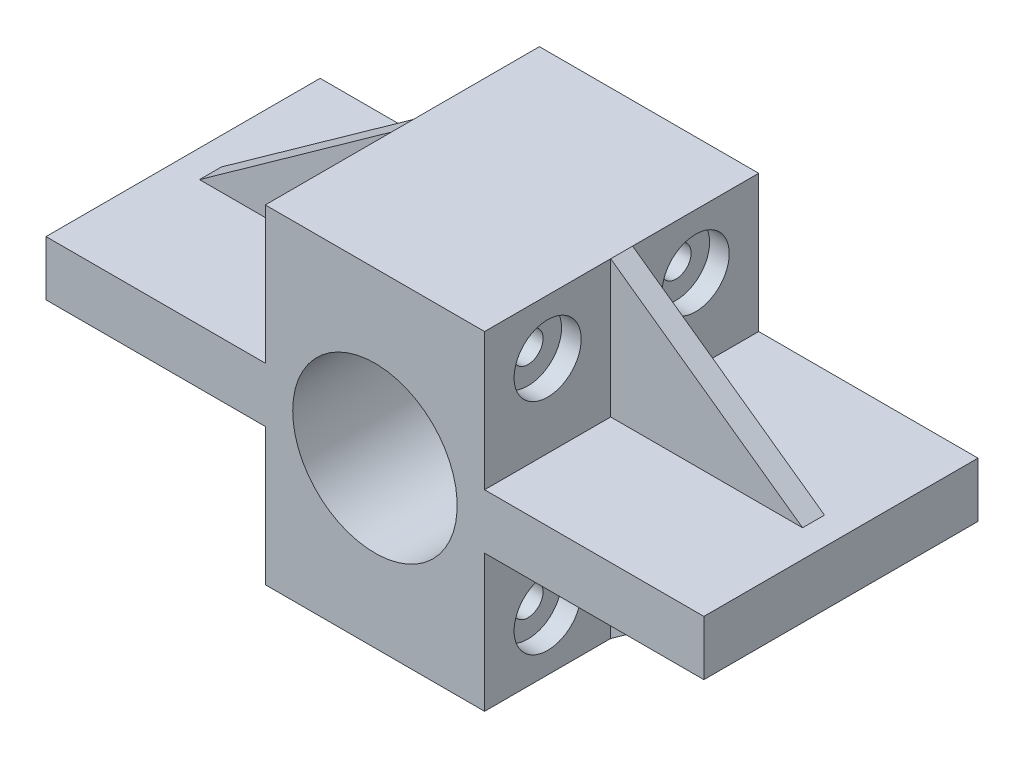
ISO-10303-21;
HEADER;
FILE_DESCRIPTION(('STEP AP214'),'2;1');
FILE_NAME('part.step','',(''),(''),'','','');
FILE_SCHEMA(('AUTOMOTIVE_DESIGN { 1 0 10303 214 1 1 1 1 }'));
ENDSEC;
DATA;
#1=APPLICATION_CONTEXT('core data for automotive mechanical design processes');
#2=APPLICATION_PROTOCOL_DEFINITION('international standard','automotive_design',2000,#1);
#3=PRODUCT_CONTEXT('',#1,'mechanical');
#4=PRODUCT('Part','Part','',(#3));
#5=PRODUCT_RELATED_PRODUCT_CATEGORY('part','',(#4));
#6=PRODUCT_DEFINITION_FORMATION('','',#4);
#7=PRODUCT_DEFINITION_CONTEXT('part definition',#1,'design');
#8=PRODUCT_DEFINITION('design','',#6,#7);
#9=PRODUCT_DEFINITION_SHAPE('','',#8);
#10=(LENGTH_UNIT() NAMED_UNIT(*) SI_UNIT(.MILLI.,.METRE.));
#11=(NAMED_UNIT(*) PLANE_ANGLE_UNIT() SI_UNIT($,.RADIAN.));
#12=(NAMED_UNIT(*) SI_UNIT($,.STERADIAN.) SOLID_ANGLE_UNIT());
#13=UNCERTAINTY_MEASURE_WITH_UNIT(LENGTH_MEASURE(1.E-05),#10,'distance_accuracy_value','');
#14=(GEOMETRIC_REPRESENTATION_CONTEXT(3) GLOBAL_UNCERTAINTY_ASSIGNED_CONTEXT((#13)) GLOBAL_UNIT_ASSIGNED_CONTEXT((#10,
#11,#12)) REPRESENTATION_CONTEXT('',''));
#15=CARTESIAN_POINT('',(0.,0.,0.));
#16=DIRECTION('',(0.,0.,1.));
#17=DIRECTION('',(1.,0.,0.));
#18=AXIS2_PLACEMENT_3D('',#15,#16,#17);
#19=CARTESIAN_POINT('',(-20.,5.,25.));
#20=DIRECTION('',(1.,0.,0.));
#21=DIRECTION('',(0.,1.,0.));
#22=AXIS2_PLACEMENT_3D('',#19,#20,#21);
#23=PLANE('',#22);
#24=CARTESIAN_POINT('',(-20.,20.,-13.5));
#25=DIRECTION('',(-1.,0.,0.));
#26=DIRECTION('',(0.,0.,1.));
#27=AXIS2_PLACEMENT_3D('',#24,#25,#26);
#28=CIRCLE('',#27,6.12);
#29=CARTESIAN_POINT('',(-20.,20.,-7.38));
#30=VERTEX_POINT('',#29);
#31=EDGE_CURVE('E373',#30,#30,#28,.T.);
#32=ORIENTED_EDGE('',*,*,#31,.F.);
#33=EDGE_LOOP('',(#32));
#34=FACE_BOUND('',#33,.T.);
#35=DIRECTION('',(0.,-1.,0.));
#36=VECTOR('',#35,1.);
#37=CARTESIAN_POINT('',(-20.,5.,-2.));
#38=LINE('',#37,#36);
#39=CARTESIAN_POINT('',(-20.,30.,-2.));
#40=VERTEX_POINT('',#39);
#41=CARTESIAN_POINT('',(-20.,5.,-2.));
#42=VERTEX_POINT('',#41);
#43=EDGE_CURVE('E48',#40,#42,#38,.T.);
#44=ORIENTED_EDGE('',*,*,#43,.F.);
#45=DIRECTION('',(0.,0.,-1.));
#46=VECTOR('',#45,1.);
#47=CARTESIAN_POINT('',(-20.,30.,25.));
#48=LINE('',#47,#46);
#49=CARTESIAN_POINT('',(-20.,30.,-25.));
#50=VERTEX_POINT('',#49);
#51=EDGE_CURVE('E492',#40,#50,#48,.T.);
#52=ORIENTED_EDGE('',*,*,#51,.T.);
#53=DIRECTION('',(0.,-1.,0.));
#54=VECTOR('',#53,1.);
#55=CARTESIAN_POINT('',(-20.,5.,-25.));
#56=LINE('',#55,#54);
#57=CARTESIAN_POINT('',(-20.,5.,-25.));
#58=VERTEX_POINT('',#57);
#59=EDGE_CURVE('E480',#50,#58,#56,.T.);
#60=ORIENTED_EDGE('',*,*,#59,.T.);
#61=DIRECTION('',(0.,0.,-1.));
#62=VECTOR('',#61,1.);
#63=CARTESIAN_POINT('',(-20.,5.,25.));
#64=LINE('',#63,#62);
#65=EDGE_CURVE('E488',#42,#58,#64,.T.);
#66=ORIENTED_EDGE('',*,*,#65,.F.);
#67=EDGE_LOOP('',(#44,#52,#60,#66));
#68=FACE_BOUND('',#67,.T.);
#69=ADVANCED_FACE('F33',(#34,#68),#23,.F.);
#70=CARTESIAN_POINT('',(20.,5.,25.));
#71=DIRECTION('',(-1.,0.,0.));
#72=DIRECTION('',(0.,-1.,0.));
#73=AXIS2_PLACEMENT_3D('',#70,#71,#72);
#74=PLANE('',#73);
#75=CARTESIAN_POINT('',(20.,20.,-13.5));
#76=DIRECTION('',(1.,0.,0.));
#77=DIRECTION('',(0.,0.,-1.));
#78=AXIS2_PLACEMENT_3D('',#75,#76,#77);
#79=CIRCLE('',#78,6.12);
#80=CARTESIAN_POINT('',(20.,20.,-19.62));
#81=VERTEX_POINT('',#80);
#82=EDGE_CURVE('E414',#81,#81,#79,.T.);
#83=ORIENTED_EDGE('',*,*,#82,.F.);
#84=EDGE_LOOP('',(#83));
#85=FACE_BOUND('',#84,.T.);
#86=DIRECTION('',(0.,1.,0.));
#87=VECTOR('',#86,1.);
#88=CARTESIAN_POINT('',(20.,5.,-2.));
#89=LINE('',#88,#87);
#90=CARTESIAN_POINT('',(20.,5.,-2.));
#91=VERTEX_POINT('',#90);
#92=CARTESIAN_POINT('',(20.,30.,-2.));
#93=VERTEX_POINT('',#92);
#94=EDGE_CURVE('E430',#91,#93,#89,.T.);
#95=ORIENTED_EDGE('',*,*,#94,.F.);
#96=DIRECTION('',(0.,0.,-1.));
#97=VECTOR('',#96,1.);
#98=CARTESIAN_POINT('',(20.,5.,25.));
#99=LINE('',#98,#97);
#100=CARTESIAN_POINT('',(20.,5.,-25.));
#101=VERTEX_POINT('',#100);
#102=EDGE_CURVE('E498',#91,#101,#99,.T.);
#103=ORIENTED_EDGE('',*,*,#102,.T.);
#104=DIRECTION('',(0.,1.,0.));
#105=VECTOR('',#104,1.);
#106=CARTESIAN_POINT('',(20.,5.,-25.));
#107=LINE('',#106,#105);
#108=CARTESIAN_POINT('',(20.,30.,-25.));
#109=VERTEX_POINT('',#108);
#110=EDGE_CURVE('E474',#101,#109,#107,.T.);
#111=ORIENTED_EDGE('',*,*,#110,.T.);
#112=DIRECTION('',(0.,0.,-1.));
#113=VECTOR('',#112,1.);
#114=CARTESIAN_POINT('',(20.,30.,25.));
#115=LINE('',#114,#113);
#116=EDGE_CURVE('E495',#93,#109,#115,.T.);
#117=ORIENTED_EDGE('',*,*,#116,.F.);
#118=EDGE_LOOP('',(#95,#103,#111,#117));
#119=FACE_BOUND('',#118,.T.);
#120=ADVANCED_FACE('F507',(#85,#119),#74,.F.);
#121=CARTESIAN_POINT('',(0.,0.,25.));
#122=DIRECTION('',(0.,0.,-1.));
#123=DIRECTION('',(-1.,0.,0.));
#124=AXIS2_PLACEMENT_3D('',#121,#122,#123);
#125=CYLINDRICAL_SURFACE('',#124,15.);
#126=CARTESIAN_POINT('',(0.,0.,-25.));
#127=DIRECTION('',(0.,0.,-1.));
#128=DIRECTION('',(-1.,0.,0.));
#129=AXIS2_PLACEMENT_3D('',#126,#127,#128);
#130=CIRCLE('',#129,15.);
#131=CARTESIAN_POINT('',(-15.,0.,-25.));
#132=VERTEX_POINT('',#131);
#133=EDGE_CURVE('E446',#132,#132,#130,.T.);
#134=ORIENTED_EDGE('',*,*,#133,.T.);
#135=EDGE_LOOP('',(#134));
#136=FACE_BOUND('',#135,.T.);
#137=CARTESIAN_POINT('',(0.,0.,25.));
#138=DIRECTION('',(0.,0.,-1.));
#139=DIRECTION('',(-1.,0.,0.));
#140=AXIS2_PLACEMENT_3D('',#137,#138,#139);
#141=CIRCLE('',#140,15.);
#142=CARTESIAN_POINT('',(-15.,0.,25.));
#143=VERTEX_POINT('',#142);
#144=EDGE_CURVE('E447',#143,#143,#141,.T.);
#145=ORIENTED_EDGE('',*,*,#144,.F.);
#146=EDGE_LOOP('',(#145));
#147=FACE_BOUND('',#146,.T.);
#148=ADVANCED_FACE('F35',(#136,#147),#125,.F.);
#149=CARTESIAN_POINT('',(60.,0.,25.));
#150=DIRECTION('',(-1.,0.,0.));
#151=DIRECTION('',(0.,0.,1.));
#152=AXIS2_PLACEMENT_3D('',#149,#150,#151);
#153=PLANE('',#152);
#154=DIRECTION('',(0.,1.,0.));
#155=VECTOR('',#154,1.);
#156=CARTESIAN_POINT('',(60.,0.,25.));
#157=LINE('',#156,#155);
#158=CARTESIAN_POINT('',(60.,-4.99999999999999,25.));
#159=VERTEX_POINT('',#158);
#160=CARTESIAN_POINT('',(60.,5.00000000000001,25.));
#161=VERTEX_POINT('',#160);
#162=EDGE_CURVE('E450',#159,#161,#157,.T.);
#163=ORIENTED_EDGE('',*,*,#162,.F.);
#164=DIRECTION('',(0.,0.,-1.));
#165=VECTOR('',#164,1.);
#166=CARTESIAN_POINT('',(60.,-4.99999999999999,25.));
#167=LINE('',#166,#165);
#168=CARTESIAN_POINT('',(60.,-4.99999999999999,-25.));
#169=VERTEX_POINT('',#168);
#170=EDGE_CURVE('E358',#159,#169,#167,.T.);
#171=ORIENTED_EDGE('',*,*,#170,.T.);
#172=DIRECTION('',(0.,1.,0.));
#173=VECTOR('',#172,1.);
#174=CARTESIAN_POINT('',(60.,0.,-25.));
#175=LINE('',#174,#173);
#176=CARTESIAN_POINT('',(60.,5.00000000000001,-25.));
#177=VERTEX_POINT('',#176);
#178=EDGE_CURVE('E468',#169,#177,#175,.T.);
#179=ORIENTED_EDGE('',*,*,#178,.T.);
#180=DIRECTION('',(0.,0.,-1.));
#181=VECTOR('',#180,1.);
#182=CARTESIAN_POINT('',(60.,5.00000000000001,25.));
#183=LINE('',#182,#181);
#184=EDGE_CURVE('E11',#161,#177,#183,.T.);
#185=ORIENTED_EDGE('',*,*,#184,.F.);
#186=EDGE_LOOP('',(#163,#171,#179,#185));
#187=FACE_BOUND('',#186,.T.);
#188=ADVANCED_FACE('F819',(#187),#153,.F.);
#189=CARTESIAN_POINT('',(60.,5.00000000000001,25.));
#190=DIRECTION('',(0.,-1.,0.));
#191=DIRECTION('',(1.,0.,0.));
#192=AXIS2_PLACEMENT_3D('',#189,#190,#191);
#193=PLANE('',#192);
#194=ORIENTED_EDGE('',*,*,#184,.T.);
#195=DIRECTION('',(-1.,0.,0.));
#196=VECTOR('',#195,1.);
#197=CARTESIAN_POINT('',(60.,5.00000000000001,-25.));
#198=LINE('',#197,#196);
#199=EDGE_CURVE('E471',#177,#101,#198,.T.);
#200=ORIENTED_EDGE('',*,*,#199,.T.);
#201=ORIENTED_EDGE('',*,*,#102,.F.);
#202=DIRECTION('',(-1.,0.,0.));
#203=VECTOR('',#202,1.);
#204=CARTESIAN_POINT('',(60.,5.00000000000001,-2.));
#205=LINE('',#204,#203);
#206=CARTESIAN_POINT('',(55.,5.00000000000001,-2.));
#207=VERTEX_POINT('',#206);
#208=EDGE_CURVE('E435',#207,#91,#205,.T.);
#209=ORIENTED_EDGE('',*,*,#208,.F.);
#210=DIRECTION('',(0.,0.,-1.));
#211=VECTOR('',#210,1.);
#212=CARTESIAN_POINT('',(55.,5.00000000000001,25.));
#213=LINE('',#212,#211);
#214=CARTESIAN_POINT('',(55.,5.00000000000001,2.));
#215=VERTEX_POINT('',#214);
#216=EDGE_CURVE('E443',#207,#215,#213,.F.);
#217=ORIENTED_EDGE('',*,*,#216,.T.);
#218=DIRECTION('',(-1.,0.,0.));
#219=VECTOR('',#218,1.);
#220=CARTESIAN_POINT('',(60.,5.00000000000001,2.));
#221=LINE('',#220,#219);
#222=CARTESIAN_POINT('',(20.,5.,2.));
#223=VERTEX_POINT('',#222);
#224=EDGE_CURVE('E440',#215,#223,#221,.T.);
#225=ORIENTED_EDGE('',*,*,#224,.T.);
#226=CARTESIAN_POINT('',(20.,5.,25.));
#227=VERTEX_POINT('',#226);
#228=EDGE_CURVE('E41',#227,#223,#99,.T.);
#229=ORIENTED_EDGE('',*,*,#228,.F.);
#230=DIRECTION('',(-1.,0.,0.));
#231=VECTOR('',#230,1.);
#232=CARTESIAN_POINT('',(60.,5.00000000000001,25.));
#233=LINE('',#232,#231);
#234=EDGE_CURVE('E453',#161,#227,#233,.T.);
#235=ORIENTED_EDGE('',*,*,#234,.F.);
#236=EDGE_LOOP('',(#194,#200,#201,#209,#217,#225,#229,#235));
#237=FACE_BOUND('',#236,.T.);
#238=ADVANCED_FACE('F514',(#237),#193,.F.);
#239=CARTESIAN_POINT('',(20.,20.,13.5));
#240=DIRECTION('',(1.,0.,0.));
#241=DIRECTION('',(0.,0.,-1.));
#242=AXIS2_PLACEMENT_3D('',#239,#240,#241);
#243=CIRCLE('',#242,6.12);
#244=CARTESIAN_POINT('',(20.,20.,7.38));
#245=VERTEX_POINT('',#244);
#246=EDGE_CURVE('E402',#245,#245,#243,.T.);
#247=ORIENTED_EDGE('',*,*,#246,.F.);
#248=EDGE_LOOP('',(#247));
#249=FACE_BOUND('',#248,.T.);
#250=ORIENTED_EDGE('',*,*,#228,.T.);
#251=DIRECTION('',(0.,1.,0.));
#252=VECTOR('',#251,1.);
#253=CARTESIAN_POINT('',(20.,5.,2.));
#254=LINE('',#253,#252);
#255=CARTESIAN_POINT('',(20.,30.,2.));
#256=VERTEX_POINT('',#255);
#257=EDGE_CURVE('E437',#223,#256,#254,.T.);
#258=ORIENTED_EDGE('',*,*,#257,.T.);
#259=CARTESIAN_POINT('',(20.,30.,25.));
#260=VERTEX_POINT('',#259);
#261=EDGE_CURVE('E496',#260,#256,#115,.T.);
#262=ORIENTED_EDGE('',*,*,#261,.F.);
#263=DIRECTION('',(0.,1.,0.));
#264=VECTOR('',#263,1.);
#265=CARTESIAN_POINT('',(20.,5.,25.));
#266=LINE('',#265,#264);
#267=EDGE_CURVE('E455',#227,#260,#266,.T.);
#268=ORIENTED_EDGE('',*,*,#267,.F.);
#269=EDGE_LOOP('',(#250,#258,#262,#268));
#270=FACE_BOUND('',#269,.T.);
#271=ADVANCED_FACE('F531',(#249,#270),#74,.F.);
#272=CARTESIAN_POINT('',(-20.,30.,25.));
#273=DIRECTION('',(0.,-1.,0.));
#274=DIRECTION('',(1.,0.,0.));
#275=AXIS2_PLACEMENT_3D('',#272,#273,#274);
#276=PLANE('',#275);
#277=ORIENTED_EDGE('',*,*,#261,.T.);
#278=EDGE_CURVE('E499',#256,#93,#115,.T.);
#279=ORIENTED_EDGE('',*,*,#278,.T.);
#280=ORIENTED_EDGE('',*,*,#116,.T.);
#281=DIRECTION('',(-1.,0.,0.));
#282=VECTOR('',#281,1.);
#283=CARTESIAN_POINT('',(-20.,30.,-25.));
#284=LINE('',#283,#282);
#285=EDGE_CURVE('E477',#109,#50,#284,.T.);
#286=ORIENTED_EDGE('',*,*,#285,.T.);
#287=ORIENTED_EDGE('',*,*,#51,.F.);
#288=DIRECTION('',(0.,0.,1.));
#289=VECTOR('',#288,1.);
#290=CARTESIAN_POINT('',(-20.,30.,25.));
#291=LINE('',#290,#289);
#292=CARTESIAN_POINT('',(-20.,30.,2.));
#293=VERTEX_POINT('',#292);
#294=EDGE_CURVE('E55',#40,#293,#291,.T.);
#295=ORIENTED_EDGE('',*,*,#294,.T.);
#296=CARTESIAN_POINT('',(-20.,30.,25.));
#297=VERTEX_POINT('',#296);
#298=EDGE_CURVE('E493',#297,#293,#48,.T.);
#299=ORIENTED_EDGE('',*,*,#298,.F.);
#300=DIRECTION('',(-1.,0.,0.));
#301=VECTOR('',#300,1.);
#302=CARTESIAN_POINT('',(-20.,30.,25.));
#303=LINE('',#302,#301);
#304=EDGE_CURVE('E457',#260,#297,#303,.T.);
#305=ORIENTED_EDGE('',*,*,#304,.F.);
#306=EDGE_LOOP('',(#277,#279,#280,#286,#287,#295,#299,#305));
#307=FACE_BOUND('',#306,.T.);
#308=ADVANCED_FACE('F522',(#307),#276,.F.);
#309=CARTESIAN_POINT('',(-20.,20.,13.5));
#310=DIRECTION('',(-1.,0.,0.));
#311=DIRECTION('',(0.,0.,1.));
#312=AXIS2_PLACEMENT_3D('',#309,#310,#311);
#313=CIRCLE('',#312,6.12);
#314=CARTESIAN_POINT('',(-20.,20.,19.62));
#315=VERTEX_POINT('',#314);
#316=EDGE_CURVE('E361',#315,#315,#313,.T.);
#317=ORIENTED_EDGE('',*,*,#316,.F.);
#318=EDGE_LOOP('',(#317));
#319=FACE_BOUND('',#318,.T.);
#320=ORIENTED_EDGE('',*,*,#298,.T.);
#321=DIRECTION('',(0.,-1.,0.));
#322=VECTOR('',#321,1.);
#323=CARTESIAN_POINT('',(-20.,5.,2.));
#324=LINE('',#323,#322);
#325=CARTESIAN_POINT('',(-20.,5.,2.));
#326=VERTEX_POINT('',#325);
#327=EDGE_CURVE('E395',#293,#326,#324,.T.);
#328=ORIENTED_EDGE('',*,*,#327,.T.);
#329=CARTESIAN_POINT('',(-20.,5.,25.));
#330=VERTEX_POINT('',#329);
#331=EDGE_CURVE('E489',#330,#326,#64,.T.);
#332=ORIENTED_EDGE('',*,*,#331,.F.);
#333=DIRECTION('',(0.,-1.,0.));
#334=VECTOR('',#333,1.);
#335=CARTESIAN_POINT('',(-20.,5.,25.));
#336=LINE('',#335,#334);
#337=EDGE_CURVE('E459',#297,#330,#336,.T.);
#338=ORIENTED_EDGE('',*,*,#337,.F.);
#339=EDGE_LOOP('',(#320,#328,#332,#338));
#340=FACE_BOUND('',#339,.T.);
#341=ADVANCED_FACE('F555',(#319,#340),#23,.F.);
#342=CARTESIAN_POINT('',(-60.,5.,25.));
#343=DIRECTION('',(0.,-1.,0.));
#344=DIRECTION('',(0.,0.,-1.));
#345=AXIS2_PLACEMENT_3D('',#342,#343,#344);
#346=PLANE('',#345);
#347=ORIENTED_EDGE('',*,*,#331,.T.);
#348=DIRECTION('',(-1.,0.,0.));
#349=VECTOR('',#348,1.);
#350=CARTESIAN_POINT('',(-60.,5.,2.));
#351=LINE('',#350,#349);
#352=CARTESIAN_POINT('',(-55.,5.,2.));
#353=VERTEX_POINT('',#352);
#354=EDGE_CURVE('E397',#326,#353,#351,.T.);
#355=ORIENTED_EDGE('',*,*,#354,.T.);
#356=DIRECTION('',(0.,0.,-1.));
#357=VECTOR('',#356,1.);
#358=CARTESIAN_POINT('',(-55.,5.,25.));
#359=LINE('',#358,#357);
#360=CARTESIAN_POINT('',(-55.,5.,-2.));
#361=VERTEX_POINT('',#360);
#362=EDGE_CURVE('E399',#353,#361,#359,.T.);
#363=ORIENTED_EDGE('',*,*,#362,.T.);
#364=DIRECTION('',(-1.,0.,0.));
#365=VECTOR('',#364,1.);
#366=CARTESIAN_POINT('',(-60.,5.,-2.));
#367=LINE('',#366,#365);
#368=EDGE_CURVE('E392',#42,#361,#367,.T.);
#369=ORIENTED_EDGE('',*,*,#368,.F.);
#370=ORIENTED_EDGE('',*,*,#65,.T.);
#371=DIRECTION('',(-1.,0.,0.));
#372=VECTOR('',#371,1.);
#373=CARTESIAN_POINT('',(-60.,5.,-25.));
#374=LINE('',#373,#372);
#375=CARTESIAN_POINT('',(-60.,5.,-25.));
#376=VERTEX_POINT('',#375);
#377=EDGE_CURVE('E483',#58,#376,#374,.T.);
#378=ORIENTED_EDGE('',*,*,#377,.T.);
#379=DIRECTION('',(0.,0.,-1.));
#380=VECTOR('',#379,1.);
#381=CARTESIAN_POINT('',(-60.,5.,25.));
#382=LINE('',#381,#380);
#383=CARTESIAN_POINT('',(-60.,5.,25.));
#384=VERTEX_POINT('',#383);
#385=EDGE_CURVE('E465',#384,#376,#382,.T.);
#386=ORIENTED_EDGE('',*,*,#385,.F.);
#387=DIRECTION('',(-1.,0.,0.));
#388=VECTOR('',#387,1.);
#389=CARTESIAN_POINT('',(-60.,5.,25.));
#390=LINE('',#389,#388);
#391=EDGE_CURVE('E461',#330,#384,#390,.T.);
#392=ORIENTED_EDGE('',*,*,#391,.F.);
#393=EDGE_LOOP('',(#347,#355,#363,#369,#370,#378,#386,#392));
#394=FACE_BOUND('',#393,.T.);
#395=ADVANCED_FACE('F565',(#394),#346,.F.);
#396=CARTESIAN_POINT('',(-60.,0.,25.));
#397=DIRECTION('',(1.,0.,0.));
#398=DIRECTION('',(0.,0.,-1.));
#399=AXIS2_PLACEMENT_3D('',#396,#397,#398);
#400=PLANE('',#399);
#401=DIRECTION('',(0.,-1.,0.));
#402=VECTOR('',#401,1.);
#403=CARTESIAN_POINT('',(-60.,0.,-25.));
#404=LINE('',#403,#402);
#405=CARTESIAN_POINT('',(-60.,-5.00000000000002,-25.));
#406=VERTEX_POINT('',#405);
#407=EDGE_CURVE('E451',#376,#406,#404,.T.);
#408=ORIENTED_EDGE('',*,*,#407,.T.);
#409=DIRECTION('',(0.,0.,-1.));
#410=VECTOR('',#409,1.);
#411=CARTESIAN_POINT('',(-60.,-5.00000000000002,25.));
#412=LINE('',#411,#410);
#413=CARTESIAN_POINT('',(-60.,-5.00000000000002,25.));
#414=VERTEX_POINT('',#413);
#415=EDGE_CURVE('E327',#414,#406,#412,.T.);
#416=ORIENTED_EDGE('',*,*,#415,.F.);
#417=DIRECTION('',(0.,-1.,0.));
#418=VECTOR('',#417,1.);
#419=CARTESIAN_POINT('',(-60.,0.,25.));
#420=LINE('',#419,#418);
#421=EDGE_CURVE('E463',#384,#414,#420,.T.);
#422=ORIENTED_EDGE('',*,*,#421,.F.);
#423=ORIENTED_EDGE('',*,*,#385,.T.);
#424=EDGE_LOOP('',(#408,#416,#422,#423));
#425=FACE_BOUND('',#424,.T.);
#426=ADVANCED_FACE('F571',(#425),#400,.F.);
#427=CARTESIAN_POINT('',(0.,0.,25.));
#428=DIRECTION('',(0.,0.,-1.));
#429=DIRECTION('',(-1.,0.,0.));
#430=AXIS2_PLACEMENT_3D('',#427,#428,#429);
#431=PLANE('',#430);
#432=DIRECTION('',(-1.,0.,0.));
#433=VECTOR('',#432,1.);
#434=CARTESIAN_POINT('',(60.,-4.99999999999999,25.));
#435=LINE('',#434,#433);
#436=CARTESIAN_POINT('',(20.,-4.99999999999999,25.));
#437=VERTEX_POINT('',#436);
#438=EDGE_CURVE('E311',#159,#437,#435,.T.);
#439=ORIENTED_EDGE('',*,*,#438,.F.);
#440=ORIENTED_EDGE('',*,*,#162,.T.);
#441=ORIENTED_EDGE('',*,*,#234,.T.);
#442=ORIENTED_EDGE('',*,*,#267,.T.);
#443=ORIENTED_EDGE('',*,*,#304,.T.);
#444=ORIENTED_EDGE('',*,*,#337,.T.);
#445=ORIENTED_EDGE('',*,*,#391,.T.);
#446=ORIENTED_EDGE('',*,*,#421,.T.);
#447=DIRECTION('',(-1.,0.,0.));
#448=VECTOR('',#447,1.);
#449=CARTESIAN_POINT('',(-60.,-5.00000000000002,25.));
#450=LINE('',#449,#448);
#451=CARTESIAN_POINT('',(-20.,-5.00000000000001,25.));
#452=VERTEX_POINT('',#451);
#453=EDGE_CURVE('E324',#452,#414,#450,.T.);
#454=ORIENTED_EDGE('',*,*,#453,.F.);
#455=DIRECTION('',(0.,1.,0.));
#456=VECTOR('',#455,1.);
#457=CARTESIAN_POINT('',(-20.,-5.00000000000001,25.));
#458=LINE('',#457,#456);
#459=CARTESIAN_POINT('',(-20.,-30.,25.));
#460=VERTEX_POINT('',#459);
#461=EDGE_CURVE('E321',#460,#452,#458,.T.);
#462=ORIENTED_EDGE('',*,*,#461,.F.);
#463=DIRECTION('',(-1.,0.,0.));
#464=VECTOR('',#463,1.);
#465=CARTESIAN_POINT('',(-20.,-30.,25.));
#466=LINE('',#465,#464);
#467=CARTESIAN_POINT('',(20.,-30.,25.));
#468=VERTEX_POINT('',#467);
#469=EDGE_CURVE('E318',#468,#460,#466,.T.);
#470=ORIENTED_EDGE('',*,*,#469,.F.);
#471=DIRECTION('',(0.,-1.,0.));
#472=VECTOR('',#471,1.);
#473=CARTESIAN_POINT('',(20.,-4.99999999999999,25.));
#474=LINE('',#473,#472);
#475=EDGE_CURVE('E314',#437,#468,#474,.T.);
#476=ORIENTED_EDGE('',*,*,#475,.F.);
#477=EDGE_LOOP('',(#439,#440,#441,#442,#443,#444,#445,#446,#454,#462,#470,#476));
#478=FACE_BOUND('',#477,.T.);
#479=ORIENTED_EDGE('',*,*,#144,.T.);
#480=EDGE_LOOP('',(#479));
#481=FACE_BOUND('',#480,.T.);
#482=ADVANCED_FACE('F535',(#478,#481),#431,.F.);
#483=CARTESIAN_POINT('',(0.,0.,-25.));
#484=DIRECTION('',(0.,0.,-1.));
#485=DIRECTION('',(-1.,0.,0.));
#486=AXIS2_PLACEMENT_3D('',#483,#484,#485);
#487=PLANE('',#486);
#488=ORIENTED_EDGE('',*,*,#178,.F.);
#489=DIRECTION('',(-1.,0.,0.));
#490=VECTOR('',#489,1.);
#491=CARTESIAN_POINT('',(60.,-4.99999999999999,-25.));
#492=LINE('',#491,#490);
#493=CARTESIAN_POINT('',(20.,-4.99999999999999,-25.));
#494=VERTEX_POINT('',#493);
#495=EDGE_CURVE('E310',#169,#494,#492,.T.);
#496=ORIENTED_EDGE('',*,*,#495,.T.);
#497=DIRECTION('',(0.,-1.,0.));
#498=VECTOR('',#497,1.);
#499=CARTESIAN_POINT('',(20.,-4.99999999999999,-25.));
#500=LINE('',#499,#498);
#501=CARTESIAN_POINT('',(20.,-30.,-25.));
#502=VERTEX_POINT('',#501);
#503=EDGE_CURVE('E329',#494,#502,#500,.T.);
#504=ORIENTED_EDGE('',*,*,#503,.T.);
#505=DIRECTION('',(-1.,0.,0.));
#506=VECTOR('',#505,1.);
#507=CARTESIAN_POINT('',(-20.,-30.,-25.));
#508=LINE('',#507,#506);
#509=CARTESIAN_POINT('',(-20.,-30.,-25.));
#510=VERTEX_POINT('',#509);
#511=EDGE_CURVE('E332',#502,#510,#508,.T.);
#512=ORIENTED_EDGE('',*,*,#511,.T.);
#513=DIRECTION('',(0.,1.,0.));
#514=VECTOR('',#513,1.);
#515=CARTESIAN_POINT('',(-20.,-5.00000000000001,-25.));
#516=LINE('',#515,#514);
#517=CARTESIAN_POINT('',(-20.,-5.00000000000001,-25.));
#518=VERTEX_POINT('',#517);
#519=EDGE_CURVE('E334',#510,#518,#516,.T.);
#520=ORIENTED_EDGE('',*,*,#519,.T.);
#521=DIRECTION('',(-1.,0.,0.));
#522=VECTOR('',#521,1.);
#523=CARTESIAN_POINT('',(-60.,-5.00000000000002,-25.));
#524=LINE('',#523,#522);
#525=EDGE_CURVE('E315',#518,#406,#524,.T.);
#526=ORIENTED_EDGE('',*,*,#525,.T.);
#527=ORIENTED_EDGE('',*,*,#407,.F.);
#528=ORIENTED_EDGE('',*,*,#377,.F.);
#529=ORIENTED_EDGE('',*,*,#59,.F.);
#530=ORIENTED_EDGE('',*,*,#285,.F.);
#531=ORIENTED_EDGE('',*,*,#110,.F.);
#532=ORIENTED_EDGE('',*,*,#199,.F.);
#533=EDGE_LOOP('',(#488,#496,#504,#512,#520,#526,#527,#528,#529,#530,#531,#532));
#534=FACE_BOUND('',#533,.T.);
#535=ORIENTED_EDGE('',*,*,#133,.F.);
#536=EDGE_LOOP('',(#535));
#537=FACE_BOUND('',#536,.T.);
#538=ADVANCED_FACE('F518',(#534,#537),#487,.T.);
#539=CARTESIAN_POINT('',(20.,30.,0.));
#540=DIRECTION('',(-0.581238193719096,-0.813733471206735,0.));
#541=DIRECTION('',(0.813733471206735,-0.581238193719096,0.));
#542=AXIS2_PLACEMENT_3D('',#539,#540,#541);
#543=PLANE('',#542);
#544=ORIENTED_EDGE('',*,*,#216,.F.);
#545=DIRECTION('',(0.813733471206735,-0.581238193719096,0.));
#546=VECTOR('',#545,1.);
#547=CARTESIAN_POINT('',(20.,30.,-2.));
#548=LINE('',#547,#546);
#549=EDGE_CURVE('E426',#93,#207,#548,.T.);
#550=ORIENTED_EDGE('',*,*,#549,.F.);
#551=ORIENTED_EDGE('',*,*,#278,.F.);
#552=DIRECTION('',(0.813733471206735,-0.581238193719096,0.));
#553=VECTOR('',#552,1.);
#554=CARTESIAN_POINT('',(20.,30.,2.));
#555=LINE('',#554,#553);
#556=EDGE_CURVE('E427',#256,#215,#555,.T.);
#557=ORIENTED_EDGE('',*,*,#556,.T.);
#558=EDGE_LOOP('',(#544,#550,#551,#557));
#559=FACE_BOUND('',#558,.T.);
#560=ADVANCED_FACE('F528',(#559),#543,.F.);
#561=CARTESIAN_POINT('',(0.,15.,2.));
#562=DIRECTION('',(0.,0.,1.));
#563=DIRECTION('',(1.,0.,0.));
#564=AXIS2_PLACEMENT_3D('',#561,#562,#563);
#565=PLANE('',#564);
#566=ORIENTED_EDGE('',*,*,#224,.F.);
#567=ORIENTED_EDGE('',*,*,#556,.F.);
#568=ORIENTED_EDGE('',*,*,#257,.F.);
#569=EDGE_LOOP('',(#566,#567,#568));
#570=FACE_BOUND('',#569,.T.);
#571=ADVANCED_FACE('F530',(#570),#565,.T.);
#572=CARTESIAN_POINT('',(0.,15.,-2.));
#573=DIRECTION('',(0.,0.,1.));
#574=DIRECTION('',(1.,0.,0.));
#575=AXIS2_PLACEMENT_3D('',#572,#573,#574);
#576=PLANE('',#575);
#577=ORIENTED_EDGE('',*,*,#549,.T.);
#578=ORIENTED_EDGE('',*,*,#208,.T.);
#579=ORIENTED_EDGE('',*,*,#94,.T.);
#580=EDGE_LOOP('',(#577,#578,#579));
#581=FACE_BOUND('',#580,.T.);
#582=ADVANCED_FACE('F539',(#581),#576,.F.);
#583=CARTESIAN_POINT('',(10.,20.,-13.5));
#584=DIRECTION('',(1.,0.,0.));
#585=DIRECTION('',(0.,0.,-1.));
#586=AXIS2_PLACEMENT_3D('',#583,#584,#585);
#587=CONICAL_SURFACE('',#586,2.75,1.02974425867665);
#588=CARTESIAN_POINT('',(8.34763329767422,20.,-13.5));
#589=VERTEX_POINT('',#588);
#590=VERTEX_LOOP('',#589);
#591=FACE_BOUND('',#590,.T.);
#592=CARTESIAN_POINT('',(10.,20.,-13.5));
#593=DIRECTION('',(1.,0.,0.));
#594=DIRECTION('',(0.,0.,-1.));
#595=AXIS2_PLACEMENT_3D('',#592,#593,#594);
#596=CIRCLE('',#595,2.75);
#597=CARTESIAN_POINT('',(10.,20.,-16.25));
#598=VERTEX_POINT('',#597);
#599=EDGE_CURVE('E423',#598,#598,#596,.T.);
#600=ORIENTED_EDGE('',*,*,#599,.T.);
#601=EDGE_LOOP('',(#600));
#602=FACE_BOUND('',#601,.T.);
#603=ADVANCED_FACE('F541',(#591,#602),#587,.F.);
#604=CARTESIAN_POINT('',(20.,20.,-13.5));
#605=DIRECTION('',(1.,0.,0.));
#606=DIRECTION('',(0.,0.,-1.));
#607=AXIS2_PLACEMENT_3D('',#604,#605,#606);
#608=CYLINDRICAL_SURFACE('',#607,2.75);
#609=ORIENTED_EDGE('',*,*,#599,.F.);
#610=EDGE_LOOP('',(#609));
#611=FACE_BOUND('',#610,.T.);
#612=CARTESIAN_POINT('',(16.42,20.,-13.5));
#613=DIRECTION('',(1.,0.,0.));
#614=DIRECTION('',(0.,0.,-1.));
#615=AXIS2_PLACEMENT_3D('',#612,#613,#614);
#616=CIRCLE('',#615,2.75);
#617=CARTESIAN_POINT('',(16.42,20.,-16.25));
#618=VERTEX_POINT('',#617);
#619=EDGE_CURVE('E420',#618,#618,#616,.T.);
#620=ORIENTED_EDGE('',*,*,#619,.T.);
#621=EDGE_LOOP('',(#620));
#622=FACE_BOUND('',#621,.T.);
#623=ADVANCED_FACE('F547',(#611,#622),#608,.F.);
#624=CARTESIAN_POINT('',(16.42,22.75,-13.5));
#625=DIRECTION('',(-1.,0.,0.));
#626=DIRECTION('',(0.,0.,1.));
#627=AXIS2_PLACEMENT_3D('',#624,#625,#626);
#628=PLANE('',#627);
#629=ORIENTED_EDGE('',*,*,#619,.F.);
#630=EDGE_LOOP('',(#629));
#631=FACE_BOUND('',#630,.T.);
#632=CARTESIAN_POINT('',(16.42,20.,-13.5));
#633=DIRECTION('',(1.,0.,0.));
#634=DIRECTION('',(0.,0.,-1.));
#635=AXIS2_PLACEMENT_3D('',#632,#633,#634);
#636=CIRCLE('',#635,6.12);
#637=CARTESIAN_POINT('',(16.42,20.,-19.62));
#638=VERTEX_POINT('',#637);
#639=EDGE_CURVE('E417',#638,#638,#636,.T.);
#640=ORIENTED_EDGE('',*,*,#639,.T.);
#641=EDGE_LOOP('',(#640));
#642=FACE_BOUND('',#641,.T.);
#643=ADVANCED_FACE('F619',(#631,#642),#628,.F.);
#644=CARTESIAN_POINT('',(20.,20.,-13.5));
#645=DIRECTION('',(1.,0.,0.));
#646=DIRECTION('',(0.,0.,-1.));
#647=AXIS2_PLACEMENT_3D('',#644,#645,#646);
#648=CYLINDRICAL_SURFACE('',#647,6.12);
#649=ORIENTED_EDGE('',*,*,#639,.F.);
#650=EDGE_LOOP('',(#649));
#651=FACE_BOUND('',#650,.T.);
#652=ORIENTED_EDGE('',*,*,#82,.T.);
#653=EDGE_LOOP('',(#652));
#654=FACE_BOUND('',#653,.T.);
#655=ADVANCED_FACE('F615',(#651,#654),#648,.F.);
#656=CARTESIAN_POINT('',(10.,20.,13.5));
#657=DIRECTION('',(1.,0.,0.));
#658=DIRECTION('',(0.,0.,-1.));
#659=AXIS2_PLACEMENT_3D('',#656,#657,#658);
#660=CONICAL_SURFACE('',#659,2.75,1.02974425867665);
#661=CARTESIAN_POINT('',(8.34763329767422,20.,13.5));
#662=VERTEX_POINT('',#661);
#663=VERTEX_LOOP('',#662);
#664=FACE_BOUND('',#663,.T.);
#665=CARTESIAN_POINT('',(10.,20.,13.5));
#666=DIRECTION('',(1.,0.,0.));
#667=DIRECTION('',(0.,0.,-1.));
#668=AXIS2_PLACEMENT_3D('',#665,#666,#667);
#669=CIRCLE('',#668,2.75);
#670=CARTESIAN_POINT('',(10.,20.,10.75));
#671=VERTEX_POINT('',#670);
#672=EDGE_CURVE('E411',#671,#671,#669,.T.);
#673=ORIENTED_EDGE('',*,*,#672,.T.);
#674=EDGE_LOOP('',(#673));
#675=FACE_BOUND('',#674,.T.);
#676=ADVANCED_FACE('F611',(#664,#675),#660,.F.);
#677=CARTESIAN_POINT('',(20.,20.,13.5));
#678=DIRECTION('',(1.,0.,0.));
#679=DIRECTION('',(0.,0.,-1.));
#680=AXIS2_PLACEMENT_3D('',#677,#678,#679);
#681=CYLINDRICAL_SURFACE('',#680,2.75);
#682=ORIENTED_EDGE('',*,*,#672,.F.);
#683=EDGE_LOOP('',(#682));
#684=FACE_BOUND('',#683,.T.);
#685=CARTESIAN_POINT('',(16.42,20.,13.5));
#686=DIRECTION('',(1.,0.,0.));
#687=DIRECTION('',(0.,0.,-1.));
#688=AXIS2_PLACEMENT_3D('',#685,#686,#687);
#689=CIRCLE('',#688,2.75);
#690=CARTESIAN_POINT('',(16.42,20.,10.75));
#691=VERTEX_POINT('',#690);
#692=EDGE_CURVE('E408',#691,#691,#689,.T.);
#693=ORIENTED_EDGE('',*,*,#692,.T.);
#694=EDGE_LOOP('',(#693));
#695=FACE_BOUND('',#694,.T.);
#696=ADVANCED_FACE('F607',(#684,#695),#681,.F.);
#697=CARTESIAN_POINT('',(16.42,22.75,13.5));
#698=DIRECTION('',(-1.,0.,0.));
#699=DIRECTION('',(0.,0.,1.));
#700=AXIS2_PLACEMENT_3D('',#697,#698,#699);
#701=PLANE('',#700);
#702=ORIENTED_EDGE('',*,*,#692,.F.);
#703=EDGE_LOOP('',(#702));
#704=FACE_BOUND('',#703,.T.);
#705=CARTESIAN_POINT('',(16.42,20.,13.5));
#706=DIRECTION('',(1.,0.,0.));
#707=DIRECTION('',(0.,0.,-1.));
#708=AXIS2_PLACEMENT_3D('',#705,#706,#707);
#709=CIRCLE('',#708,6.12);
#710=CARTESIAN_POINT('',(16.42,20.,7.38));
#711=VERTEX_POINT('',#710);
#712=EDGE_CURVE('E405',#711,#711,#709,.T.);
#713=ORIENTED_EDGE('',*,*,#712,.T.);
#714=EDGE_LOOP('',(#713));
#715=FACE_BOUND('',#714,.T.);
#716=ADVANCED_FACE('F603',(#704,#715),#701,.F.);
#717=CARTESIAN_POINT('',(20.,20.,13.5));
#718=DIRECTION('',(1.,0.,0.));
#719=DIRECTION('',(0.,0.,-1.));
#720=AXIS2_PLACEMENT_3D('',#717,#718,#719);
#721=CYLINDRICAL_SURFACE('',#720,6.12);
#722=ORIENTED_EDGE('',*,*,#712,.F.);
#723=EDGE_LOOP('',(#722));
#724=FACE_BOUND('',#723,.T.);
#725=ORIENTED_EDGE('',*,*,#246,.T.);
#726=EDGE_LOOP('',(#725));
#727=FACE_BOUND('',#726,.T.);
#728=ADVANCED_FACE('F600',(#724,#727),#721,.F.);
#729=CARTESIAN_POINT('',(-20.,30.,0.));
#730=DIRECTION('',(-0.581238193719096,0.813733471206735,0.));
#731=DIRECTION('',(-0.813733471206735,-0.581238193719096,0.));
#732=AXIS2_PLACEMENT_3D('',#729,#730,#731);
#733=PLANE('',#732);
#734=ORIENTED_EDGE('',*,*,#294,.F.);
#735=DIRECTION('',(-0.813733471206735,-0.581238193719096,0.));
#736=VECTOR('',#735,1.);
#737=CARTESIAN_POINT('',(-20.,30.,-2.));
#738=LINE('',#737,#736);
#739=EDGE_CURVE('E385',#40,#361,#738,.T.);
#740=ORIENTED_EDGE('',*,*,#739,.T.);
#741=ORIENTED_EDGE('',*,*,#362,.F.);
#742=DIRECTION('',(-0.813733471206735,-0.581238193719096,0.));
#743=VECTOR('',#742,1.);
#744=CARTESIAN_POINT('',(-20.,30.,2.));
#745=LINE('',#744,#743);
#746=EDGE_CURVE('E386',#293,#353,#745,.T.);
#747=ORIENTED_EDGE('',*,*,#746,.F.);
#748=EDGE_LOOP('',(#734,#740,#741,#747));
#749=FACE_BOUND('',#748,.T.);
#750=ADVANCED_FACE('F582',(#749),#733,.T.);
#751=CARTESIAN_POINT('',(0.,15.,2.));
#752=DIRECTION('',(0.,0.,1.));
#753=DIRECTION('',(1.,0.,0.));
#754=AXIS2_PLACEMENT_3D('',#751,#752,#753);
#755=PLANE('',#754);
#756=ORIENTED_EDGE('',*,*,#354,.F.);
#757=ORIENTED_EDGE('',*,*,#327,.F.);
#758=ORIENTED_EDGE('',*,*,#746,.T.);
#759=EDGE_LOOP('',(#756,#757,#758));
#760=FACE_BOUND('',#759,.T.);
#761=ADVANCED_FACE('F579',(#760),#755,.T.);
#762=CARTESIAN_POINT('',(0.,15.,-2.));
#763=DIRECTION('',(0.,0.,1.));
#764=DIRECTION('',(1.,0.,0.));
#765=AXIS2_PLACEMENT_3D('',#762,#763,#764);
#766=PLANE('',#765);
#767=ORIENTED_EDGE('',*,*,#43,.T.);
#768=ORIENTED_EDGE('',*,*,#368,.T.);
#769=ORIENTED_EDGE('',*,*,#739,.F.);
#770=EDGE_LOOP('',(#767,#768,#769));
#771=FACE_BOUND('',#770,.T.);
#772=ADVANCED_FACE('F585',(#771),#766,.F.);
#773=CARTESIAN_POINT('',(-10.,20.,-13.5));
#774=DIRECTION('',(-1.,0.,0.));
#775=DIRECTION('',(0.,0.,1.));
#776=AXIS2_PLACEMENT_3D('',#773,#774,#775);
#777=CONICAL_SURFACE('',#776,2.75,1.02974425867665);
#778=CARTESIAN_POINT('',(-8.34763329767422,20.,-13.5));
#779=VERTEX_POINT('',#778);
#780=VERTEX_LOOP('',#779);
#781=FACE_BOUND('',#780,.T.);
#782=CARTESIAN_POINT('',(-10.,20.,-13.5));
#783=DIRECTION('',(-1.,0.,0.));
#784=DIRECTION('',(0.,0.,1.));
#785=AXIS2_PLACEMENT_3D('',#782,#783,#784);
#786=CIRCLE('',#785,2.75);
#787=CARTESIAN_POINT('',(-10.,20.,-10.75));
#788=VERTEX_POINT('',#787);
#789=EDGE_CURVE('E382',#788,#788,#786,.T.);
#790=ORIENTED_EDGE('',*,*,#789,.T.);
#791=EDGE_LOOP('',(#790));
#792=FACE_BOUND('',#791,.T.);
#793=ADVANCED_FACE('F587',(#781,#792),#777,.F.);
#794=CARTESIAN_POINT('',(-20.,20.,-13.5));
#795=DIRECTION('',(-1.,0.,0.));
#796=DIRECTION('',(0.,0.,1.));
#797=AXIS2_PLACEMENT_3D('',#794,#795,#796);
#798=CYLINDRICAL_SURFACE('',#797,2.75);
#799=ORIENTED_EDGE('',*,*,#789,.F.);
#800=EDGE_LOOP('',(#799));
#801=FACE_BOUND('',#800,.T.);
#802=CARTESIAN_POINT('',(-16.42,20.,-13.5));
#803=DIRECTION('',(-1.,0.,0.));
#804=DIRECTION('',(0.,0.,1.));
#805=AXIS2_PLACEMENT_3D('',#802,#803,#804);
#806=CIRCLE('',#805,2.75);
#807=CARTESIAN_POINT('',(-16.42,20.,-10.75));
#808=VERTEX_POINT('',#807);
#809=EDGE_CURVE('E379',#808,#808,#806,.T.);
#810=ORIENTED_EDGE('',*,*,#809,.T.);
#811=EDGE_LOOP('',(#810));
#812=FACE_BOUND('',#811,.T.);
#813=ADVANCED_FACE('F593',(#801,#812),#798,.F.);
#814=CARTESIAN_POINT('',(-16.42,22.75,-13.5));
#815=DIRECTION('',(1.,0.,0.));
#816=DIRECTION('',(0.,0.,-1.));
#817=AXIS2_PLACEMENT_3D('',#814,#815,#816);
#818=PLANE('',#817);
#819=ORIENTED_EDGE('',*,*,#809,.F.);
#820=EDGE_LOOP('',(#819));
#821=FACE_BOUND('',#820,.T.);
#822=CARTESIAN_POINT('',(-16.42,20.,-13.5));
#823=DIRECTION('',(-1.,0.,0.));
#824=DIRECTION('',(0.,0.,1.));
#825=AXIS2_PLACEMENT_3D('',#822,#823,#824);
#826=CIRCLE('',#825,6.12);
#827=CARTESIAN_POINT('',(-16.42,20.,-7.38));
#828=VERTEX_POINT('',#827);
#829=EDGE_CURVE('E376',#828,#828,#826,.T.);
#830=ORIENTED_EDGE('',*,*,#829,.T.);
#831=EDGE_LOOP('',(#830));
#832=FACE_BOUND('',#831,.T.);
#833=ADVANCED_FACE('F757',(#821,#832),#818,.F.);
#834=CARTESIAN_POINT('',(-20.,20.,-13.5));
#835=DIRECTION('',(-1.,0.,0.));
#836=DIRECTION('',(0.,0.,1.));
#837=AXIS2_PLACEMENT_3D('',#834,#835,#836);
#838=CYLINDRICAL_SURFACE('',#837,6.12);
#839=ORIENTED_EDGE('',*,*,#829,.F.);
#840=EDGE_LOOP('',(#839));
#841=FACE_BOUND('',#840,.T.);
#842=ORIENTED_EDGE('',*,*,#31,.T.);
#843=EDGE_LOOP('',(#842));
#844=FACE_BOUND('',#843,.T.);
#845=ADVANCED_FACE('F752',(#841,#844),#838,.F.);
#846=CARTESIAN_POINT('',(-10.,20.,13.5));
#847=DIRECTION('',(-1.,0.,0.));
#848=DIRECTION('',(0.,0.,1.));
#849=AXIS2_PLACEMENT_3D('',#846,#847,#848);
#850=CONICAL_SURFACE('',#849,2.75,1.02974425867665);
#851=CARTESIAN_POINT('',(-8.34763329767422,20.,13.5));
#852=VERTEX_POINT('',#851);
#853=VERTEX_LOOP('',#852);
#854=FACE_BOUND('',#853,.T.);
#855=CARTESIAN_POINT('',(-10.,20.,13.5));
#856=DIRECTION('',(-1.,0.,0.));
#857=DIRECTION('',(0.,0.,1.));
#858=AXIS2_PLACEMENT_3D('',#855,#856,#857);
#859=CIRCLE('',#858,2.75);
#860=CARTESIAN_POINT('',(-10.,20.,16.25));
#861=VERTEX_POINT('',#860);
#862=EDGE_CURVE('E370',#861,#861,#859,.T.);
#863=ORIENTED_EDGE('',*,*,#862,.T.);
#864=EDGE_LOOP('',(#863));
#865=FACE_BOUND('',#864,.T.);
#866=ADVANCED_FACE('F745',(#854,#865),#850,.F.);
#867=CARTESIAN_POINT('',(-20.,20.,13.5));
#868=DIRECTION('',(-1.,0.,0.));
#869=DIRECTION('',(0.,0.,1.));
#870=AXIS2_PLACEMENT_3D('',#867,#868,#869);
#871=CYLINDRICAL_SURFACE('',#870,2.75);
#872=ORIENTED_EDGE('',*,*,#862,.F.);
#873=EDGE_LOOP('',(#872));
#874=FACE_BOUND('',#873,.T.);
#875=CARTESIAN_POINT('',(-16.42,20.,13.5));
#876=DIRECTION('',(-1.,0.,0.));
#877=DIRECTION('',(0.,0.,1.));
#878=AXIS2_PLACEMENT_3D('',#875,#876,#877);
#879=CIRCLE('',#878,2.75);
#880=CARTESIAN_POINT('',(-16.42,20.,16.25));
#881=VERTEX_POINT('',#880);
#882=EDGE_CURVE('E367',#881,#881,#879,.T.);
#883=ORIENTED_EDGE('',*,*,#882,.T.);
#884=EDGE_LOOP('',(#883));
#885=FACE_BOUND('',#884,.T.);
#886=ADVANCED_FACE('F735',(#874,#885),#871,.F.);
#887=CARTESIAN_POINT('',(-16.42,22.75,13.5));
#888=DIRECTION('',(1.,0.,0.));
#889=DIRECTION('',(0.,0.,-1.));
#890=AXIS2_PLACEMENT_3D('',#887,#888,#889);
#891=PLANE('',#890);
#892=ORIENTED_EDGE('',*,*,#882,.F.);
#893=EDGE_LOOP('',(#892));
#894=FACE_BOUND('',#893,.T.);
#895=CARTESIAN_POINT('',(-16.42,20.,13.5));
#896=DIRECTION('',(-1.,0.,0.));
#897=DIRECTION('',(0.,0.,1.));
#898=AXIS2_PLACEMENT_3D('',#895,#896,#897);
#899=CIRCLE('',#898,6.12);
#900=CARTESIAN_POINT('',(-16.42,20.,19.62));
#901=VERTEX_POINT('',#900);
#902=EDGE_CURVE('E364',#901,#901,#899,.T.);
#903=ORIENTED_EDGE('',*,*,#902,.T.);
#904=EDGE_LOOP('',(#903));
#905=FACE_BOUND('',#904,.T.);
#906=ADVANCED_FACE('F724',(#894,#905),#891,.F.);
#907=CARTESIAN_POINT('',(-20.,20.,13.5));
#908=DIRECTION('',(-1.,0.,0.));
#909=DIRECTION('',(0.,0.,1.));
#910=AXIS2_PLACEMENT_3D('',#907,#908,#909);
#911=CYLINDRICAL_SURFACE('',#910,6.12);
#912=ORIENTED_EDGE('',*,*,#902,.F.);
#913=EDGE_LOOP('',(#912));
#914=FACE_BOUND('',#913,.T.);
#915=ORIENTED_EDGE('',*,*,#316,.T.);
#916=EDGE_LOOP('',(#915));
#917=FACE_BOUND('',#916,.T.);
#918=ADVANCED_FACE('F718',(#914,#917),#911,.F.);
#919=CARTESIAN_POINT('',(-20.,-5.00000000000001,25.));
#920=DIRECTION('',(1.,0.,0.));
#921=DIRECTION('',(0.,-1.,0.));
#922=AXIS2_PLACEMENT_3D('',#919,#920,#921);
#923=PLANE('',#922);
#924=CARTESIAN_POINT('',(-20.,-20.,-13.5));
#925=DIRECTION('',(1.,0.,0.));
#926=DIRECTION('',(0.,0.,1.));
#927=AXIS2_PLACEMENT_3D('',#924,#925,#926);
#928=CIRCLE('',#927,6.12);
#929=CARTESIAN_POINT('',(-20.,-20.,-7.38));
#930=VERTEX_POINT('',#929);
#931=EDGE_CURVE('E227',#930,#930,#928,.T.);
#932=ORIENTED_EDGE('',*,*,#931,.T.);
#933=EDGE_LOOP('',(#932));
#934=FACE_BOUND('',#933,.T.);
#935=DIRECTION('',(0.,1.,0.));
#936=VECTOR('',#935,1.);
#937=CARTESIAN_POINT('',(-20.,-5.00000000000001,-2.));
#938=LINE('',#937,#936);
#939=CARTESIAN_POINT('',(-20.,-30.,-2.));
#940=VERTEX_POINT('',#939);
#941=CARTESIAN_POINT('',(-20.,-5.00000000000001,-2.));
#942=VERTEX_POINT('',#941);
#943=EDGE_CURVE('E249',#940,#942,#938,.T.);
#944=ORIENTED_EDGE('',*,*,#943,.T.);
#945=DIRECTION('',(0.,0.,-1.));
#946=VECTOR('',#945,1.);
#947=CARTESIAN_POINT('',(-20.,-5.00000000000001,25.));
#948=LINE('',#947,#946);
#949=EDGE_CURVE('E341',#942,#518,#948,.T.);
#950=ORIENTED_EDGE('',*,*,#949,.T.);
#951=ORIENTED_EDGE('',*,*,#519,.F.);
#952=DIRECTION('',(0.,0.,-1.));
#953=VECTOR('',#952,1.);
#954=CARTESIAN_POINT('',(-20.,-30.,25.));
#955=LINE('',#954,#953);
#956=EDGE_CURVE('E345',#940,#510,#955,.T.);
#957=ORIENTED_EDGE('',*,*,#956,.F.);
#958=EDGE_LOOP('',(#944,#950,#951,#957));
#959=FACE_BOUND('',#958,.T.);
#960=ADVANCED_FACE('F723',(#934,#959),#923,.F.);
#961=CARTESIAN_POINT('',(20.,-4.99999999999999,25.));
#962=DIRECTION('',(-1.,0.,0.));
#963=DIRECTION('',(0.,1.,0.));
#964=AXIS2_PLACEMENT_3D('',#961,#962,#963);
#965=PLANE('',#964);
#966=CARTESIAN_POINT('',(20.,-20.,-13.5));
#967=DIRECTION('',(-1.,0.,0.));
#968=DIRECTION('',(0.,0.,-1.));
#969=AXIS2_PLACEMENT_3D('',#966,#967,#968);
#970=CIRCLE('',#969,6.12);
#971=CARTESIAN_POINT('',(20.,-20.,-19.62));
#972=VERTEX_POINT('',#971);
#973=EDGE_CURVE('E280',#972,#972,#970,.T.);
#974=ORIENTED_EDGE('',*,*,#973,.T.);
#975=EDGE_LOOP('',(#974));
#976=FACE_BOUND('',#975,.T.);
#977=DIRECTION('',(0.,-1.,0.));
#978=VECTOR('',#977,1.);
#979=CARTESIAN_POINT('',(20.,-4.99999999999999,-2.));
#980=LINE('',#979,#978);
#981=CARTESIAN_POINT('',(20.,-4.99999999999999,-2.));
#982=VERTEX_POINT('',#981);
#983=CARTESIAN_POINT('',(20.,-30.,-2.));
#984=VERTEX_POINT('',#983);
#985=EDGE_CURVE('E295',#982,#984,#980,.T.);
#986=ORIENTED_EDGE('',*,*,#985,.T.);
#987=DIRECTION('',(0.,0.,-1.));
#988=VECTOR('',#987,1.);
#989=CARTESIAN_POINT('',(20.,-30.,25.));
#990=LINE('',#989,#988);
#991=EDGE_CURVE('E349',#984,#502,#990,.T.);
#992=ORIENTED_EDGE('',*,*,#991,.T.);
#993=ORIENTED_EDGE('',*,*,#503,.F.);
#994=DIRECTION('',(0.,0.,-1.));
#995=VECTOR('',#994,1.);
#996=CARTESIAN_POINT('',(20.,-4.99999999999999,25.));
#997=LINE('',#996,#995);
#998=EDGE_CURVE('E353',#982,#494,#997,.T.);
#999=ORIENTED_EDGE('',*,*,#998,.F.);
#1000=EDGE_LOOP('',(#986,#992,#993,#999));
#1001=FACE_BOUND('',#1000,.T.);
#1002=ADVANCED_FACE('F868',(#976,#1001),#965,.F.);
#1003=CARTESIAN_POINT('',(60.,-4.99999999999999,25.));
#1004=DIRECTION('',(0.,1.,0.));
#1005=DIRECTION('',(1.,0.,0.));
#1006=AXIS2_PLACEMENT_3D('',#1003,#1004,#1005);
#1007=PLANE('',#1006);
#1008=ORIENTED_EDGE('',*,*,#170,.F.);
#1009=ORIENTED_EDGE('',*,*,#438,.T.);
#1010=CARTESIAN_POINT('',(20.,-4.99999999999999,2.));
#1011=VERTEX_POINT('',#1010);
#1012=EDGE_CURVE('E355',#437,#1011,#997,.T.);
#1013=ORIENTED_EDGE('',*,*,#1012,.T.);
#1014=DIRECTION('',(-1.,0.,0.));
#1015=VECTOR('',#1014,1.);
#1016=CARTESIAN_POINT('',(60.,-4.99999999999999,2.));
#1017=LINE('',#1016,#1015);
#1018=CARTESIAN_POINT('',(55.,-4.99999999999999,2.));
#1019=VERTEX_POINT('',#1018);
#1020=EDGE_CURVE('E304',#1019,#1011,#1017,.T.);
#1021=ORIENTED_EDGE('',*,*,#1020,.F.);
#1022=DIRECTION('',(0.,0.,-1.));
#1023=VECTOR('',#1022,1.);
#1024=CARTESIAN_POINT('',(55.,-4.99999999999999,25.));
#1025=LINE('',#1024,#1023);
#1026=CARTESIAN_POINT('',(55.,-4.99999999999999,-2.));
#1027=VERTEX_POINT('',#1026);
#1028=EDGE_CURVE('E307',#1027,#1019,#1025,.F.);
#1029=ORIENTED_EDGE('',*,*,#1028,.F.);
#1030=DIRECTION('',(-1.,0.,0.));
#1031=VECTOR('',#1030,1.);
#1032=CARTESIAN_POINT('',(60.,-4.99999999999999,-2.));
#1033=LINE('',#1032,#1031);
#1034=EDGE_CURVE('E299',#1027,#982,#1033,.T.);
#1035=ORIENTED_EDGE('',*,*,#1034,.T.);
#1036=ORIENTED_EDGE('',*,*,#998,.T.);
#1037=ORIENTED_EDGE('',*,*,#495,.F.);
#1038=EDGE_LOOP('',(#1008,#1009,#1013,#1021,#1029,#1035,#1036,#1037));
#1039=FACE_BOUND('',#1038,.T.);
#1040=ADVANCED_FACE('F879',(#1039),#1007,.F.);
#1041=CARTESIAN_POINT('',(20.,-20.,13.5));
#1042=DIRECTION('',(-1.,0.,0.));
#1043=DIRECTION('',(0.,0.,-1.));
#1044=AXIS2_PLACEMENT_3D('',#1041,#1042,#1043);
#1045=CIRCLE('',#1044,6.12);
#1046=CARTESIAN_POINT('',(20.,-20.,7.38));
#1047=VERTEX_POINT('',#1046);
#1048=EDGE_CURVE('E268',#1047,#1047,#1045,.T.);
#1049=ORIENTED_EDGE('',*,*,#1048,.T.);
#1050=EDGE_LOOP('',(#1049));
#1051=FACE_BOUND('',#1050,.T.);
#1052=ORIENTED_EDGE('',*,*,#1012,.F.);
#1053=ORIENTED_EDGE('',*,*,#475,.T.);
#1054=CARTESIAN_POINT('',(20.,-30.,2.));
#1055=VERTEX_POINT('',#1054);
#1056=EDGE_CURVE('E350',#468,#1055,#990,.T.);
#1057=ORIENTED_EDGE('',*,*,#1056,.T.);
#1058=DIRECTION('',(0.,-1.,0.));
#1059=VECTOR('',#1058,1.);
#1060=CARTESIAN_POINT('',(20.,-4.99999999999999,2.));
#1061=LINE('',#1060,#1059);
#1062=EDGE_CURVE('E301',#1011,#1055,#1061,.T.);
#1063=ORIENTED_EDGE('',*,*,#1062,.F.);
#1064=EDGE_LOOP('',(#1052,#1053,#1057,#1063));
#1065=FACE_BOUND('',#1064,.T.);
#1066=ADVANCED_FACE('F882',(#1051,#1065),#965,.F.);
#1067=CARTESIAN_POINT('',(-20.,-30.,25.));
#1068=DIRECTION('',(0.,1.,0.));
#1069=DIRECTION('',(1.,0.,0.));
#1070=AXIS2_PLACEMENT_3D('',#1067,#1068,#1069);
#1071=PLANE('',#1070);
#1072=ORIENTED_EDGE('',*,*,#1056,.F.);
#1073=ORIENTED_EDGE('',*,*,#469,.T.);
#1074=CARTESIAN_POINT('',(-20.,-30.,2.));
#1075=VERTEX_POINT('',#1074);
#1076=EDGE_CURVE('E346',#460,#1075,#955,.T.);
#1077=ORIENTED_EDGE('',*,*,#1076,.T.);
#1078=DIRECTION('',(0.,0.,1.));
#1079=VECTOR('',#1078,1.);
#1080=CARTESIAN_POINT('',(-20.,-30.,25.));
#1081=LINE('',#1080,#1079);
#1082=EDGE_CURVE('E265',#940,#1075,#1081,.T.);
#1083=ORIENTED_EDGE('',*,*,#1082,.F.);
#1084=ORIENTED_EDGE('',*,*,#956,.T.);
#1085=ORIENTED_EDGE('',*,*,#511,.F.);
#1086=ORIENTED_EDGE('',*,*,#991,.F.);
#1087=EDGE_CURVE('E354',#1055,#984,#990,.T.);
#1088=ORIENTED_EDGE('',*,*,#1087,.F.);
#1089=EDGE_LOOP('',(#1072,#1073,#1077,#1083,#1084,#1085,#1086,#1088));
#1090=FACE_BOUND('',#1089,.T.);
#1091=ADVANCED_FACE('F899',(#1090),#1071,.F.);
#1092=CARTESIAN_POINT('',(-20.,-20.,13.5));
#1093=DIRECTION('',(1.,0.,0.));
#1094=DIRECTION('',(0.,0.,1.));
#1095=AXIS2_PLACEMENT_3D('',#1092,#1093,#1094);
#1096=CIRCLE('',#1095,6.12);
#1097=CARTESIAN_POINT('',(-20.,-20.,19.62));
#1098=VERTEX_POINT('',#1097);
#1099=EDGE_CURVE('E1168',#1098,#1098,#1096,.T.);
#1100=ORIENTED_EDGE('',*,*,#1099,.T.);
#1101=EDGE_LOOP('',(#1100));
#1102=FACE_BOUND('',#1101,.T.);
#1103=ORIENTED_EDGE('',*,*,#1076,.F.);
#1104=ORIENTED_EDGE('',*,*,#461,.T.);
#1105=CARTESIAN_POINT('',(-20.,-5.00000000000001,2.));
#1106=VERTEX_POINT('',#1105);
#1107=EDGE_CURVE('E342',#452,#1106,#948,.T.);
#1108=ORIENTED_EDGE('',*,*,#1107,.T.);
#1109=DIRECTION('',(0.,1.,0.));
#1110=VECTOR('',#1109,1.);
#1111=CARTESIAN_POINT('',(-20.,-5.00000000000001,2.));
#1112=LINE('',#1111,#1110);
#1113=EDGE_CURVE('E256',#1075,#1106,#1112,.T.);
#1114=ORIENTED_EDGE('',*,*,#1113,.F.);
#1115=EDGE_LOOP('',(#1103,#1104,#1108,#1114));
#1116=FACE_BOUND('',#1115,.T.);
#1117=ADVANCED_FACE('F871',(#1102,#1116),#923,.F.);
#1118=CARTESIAN_POINT('',(-60.,-5.00000000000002,25.));
#1119=DIRECTION('',(0.,1.,0.));
#1120=DIRECTION('',(0.,0.,-1.));
#1121=AXIS2_PLACEMENT_3D('',#1118,#1119,#1120);
#1122=PLANE('',#1121);
#1123=ORIENTED_EDGE('',*,*,#1107,.F.);
#1124=ORIENTED_EDGE('',*,*,#453,.T.);
#1125=ORIENTED_EDGE('',*,*,#415,.T.);
#1126=ORIENTED_EDGE('',*,*,#525,.F.);
#1127=ORIENTED_EDGE('',*,*,#949,.F.);
#1128=DIRECTION('',(-1.,0.,0.));
#1129=VECTOR('',#1128,1.);
#1130=CARTESIAN_POINT('',(-60.,-5.00000000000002,-2.));
#1131=LINE('',#1130,#1129);
#1132=CARTESIAN_POINT('',(-55.,-5.00000000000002,-2.));
#1133=VERTEX_POINT('',#1132);
#1134=EDGE_CURVE('E253',#942,#1133,#1131,.T.);
#1135=ORIENTED_EDGE('',*,*,#1134,.T.);
#1136=DIRECTION('',(0.,0.,-1.));
#1137=VECTOR('',#1136,1.);
#1138=CARTESIAN_POINT('',(-55.,-5.00000000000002,25.));
#1139=LINE('',#1138,#1137);
#1140=CARTESIAN_POINT('',(-55.,-5.00000000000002,2.));
#1141=VERTEX_POINT('',#1140);
#1142=EDGE_CURVE('E262',#1141,#1133,#1139,.T.);
#1143=ORIENTED_EDGE('',*,*,#1142,.F.);
#1144=DIRECTION('',(-1.,0.,0.));
#1145=VECTOR('',#1144,1.);
#1146=CARTESIAN_POINT('',(-60.,-5.00000000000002,2.));
#1147=LINE('',#1146,#1145);
#1148=EDGE_CURVE('E259',#1106,#1141,#1147,.T.);
#1149=ORIENTED_EDGE('',*,*,#1148,.F.);
#1150=EDGE_LOOP('',(#1123,#1124,#1125,#1126,#1127,#1135,#1143,#1149));
#1151=FACE_BOUND('',#1150,.T.);
#1152=ADVANCED_FACE('F917',(#1151),#1122,.F.);
#1153=CARTESIAN_POINT('',(20.,-30.,0.));
#1154=DIRECTION('',(-0.581238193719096,0.813733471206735,0.));
#1155=DIRECTION('',(0.813733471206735,0.581238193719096,0.));
#1156=AXIS2_PLACEMENT_3D('',#1153,#1154,#1155);
#1157=PLANE('',#1156);
#1158=ORIENTED_EDGE('',*,*,#1028,.T.);
#1159=DIRECTION('',(0.813733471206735,0.581238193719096,0.));
#1160=VECTOR('',#1159,1.);
#1161=CARTESIAN_POINT('',(20.,-30.,2.));
#1162=LINE('',#1161,#1160);
#1163=EDGE_CURVE('E293',#1055,#1019,#1162,.T.);
#1164=ORIENTED_EDGE('',*,*,#1163,.F.);
#1165=ORIENTED_EDGE('',*,*,#1087,.T.);
#1166=DIRECTION('',(0.813733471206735,0.581238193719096,0.));
#1167=VECTOR('',#1166,1.);
#1168=CARTESIAN_POINT('',(20.,-30.,-2.));
#1169=LINE('',#1168,#1167);
#1170=EDGE_CURVE('E292',#984,#1027,#1169,.T.);
#1171=ORIENTED_EDGE('',*,*,#1170,.T.);
#1172=EDGE_LOOP('',(#1158,#1164,#1165,#1171));
#1173=FACE_BOUND('',#1172,.T.);
#1174=ADVANCED_FACE('F926',(#1173),#1157,.F.);
#1175=CARTESIAN_POINT('',(0.,-15.,2.));
#1176=DIRECTION('',(0.,0.,1.));
#1177=DIRECTION('',(1.,0.,0.));
#1178=AXIS2_PLACEMENT_3D('',#1175,#1176,#1177);
#1179=PLANE('',#1178);
#1180=ORIENTED_EDGE('',*,*,#1020,.T.);
#1181=ORIENTED_EDGE('',*,*,#1062,.T.);
#1182=ORIENTED_EDGE('',*,*,#1163,.T.);
#1183=EDGE_LOOP('',(#1180,#1181,#1182));
#1184=FACE_BOUND('',#1183,.T.);
#1185=ADVANCED_FACE('F936',(#1184),#1179,.T.);
#1186=CARTESIAN_POINT('',(0.,-15.,-2.));
#1187=DIRECTION('',(0.,0.,1.));
#1188=DIRECTION('',(1.,0.,0.));
#1189=AXIS2_PLACEMENT_3D('',#1186,#1187,#1188);
#1190=PLANE('',#1189);
#1191=ORIENTED_EDGE('',*,*,#1170,.F.);
#1192=ORIENTED_EDGE('',*,*,#985,.F.);
#1193=ORIENTED_EDGE('',*,*,#1034,.F.);
#1194=EDGE_LOOP('',(#1191,#1192,#1193));
#1195=FACE_BOUND('',#1194,.T.);
#1196=ADVANCED_FACE('F946',(#1195),#1190,.F.);
#1197=CARTESIAN_POINT('',(10.,-20.,-13.5));
#1198=DIRECTION('',(1.,0.,0.));
#1199=DIRECTION('',(0.,0.,-1.));
#1200=AXIS2_PLACEMENT_3D('',#1197,#1198,#1199);
#1201=CONICAL_SURFACE('',#1200,2.75,1.02974425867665);
#1202=CARTESIAN_POINT('',(8.34763329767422,-20.,-13.5));
#1203=VERTEX_POINT('',#1202);
#1204=VERTEX_LOOP('',#1203);
#1205=FACE_BOUND('',#1204,.T.);
#1206=CARTESIAN_POINT('',(10.,-20.,-13.5));
#1207=DIRECTION('',(-1.,0.,0.));
#1208=DIRECTION('',(0.,0.,-1.));
#1209=AXIS2_PLACEMENT_3D('',#1206,#1207,#1208);
#1210=CIRCLE('',#1209,2.75);
#1211=CARTESIAN_POINT('',(10.,-20.,-16.25));
#1212=VERTEX_POINT('',#1211);
#1213=EDGE_CURVE('E289',#1212,#1212,#1210,.T.);
#1214=ORIENTED_EDGE('',*,*,#1213,.F.);
#1215=EDGE_LOOP('',(#1214));
#1216=FACE_BOUND('',#1215,.T.);
#1217=ADVANCED_FACE('F956',(#1205,#1216),#1201,.F.);
#1218=CARTESIAN_POINT('',(20.,-20.,-13.5));
#1219=DIRECTION('',(1.,0.,0.));
#1220=DIRECTION('',(0.,0.,-1.));
#1221=AXIS2_PLACEMENT_3D('',#1218,#1219,#1220);
#1222=CYLINDRICAL_SURFACE('',#1221,2.75);
#1223=ORIENTED_EDGE('',*,*,#1213,.T.);
#1224=EDGE_LOOP('',(#1223));
#1225=FACE_BOUND('',#1224,.T.);
#1226=CARTESIAN_POINT('',(16.42,-20.,-13.5));
#1227=DIRECTION('',(-1.,0.,0.));
#1228=DIRECTION('',(0.,0.,-1.));
#1229=AXIS2_PLACEMENT_3D('',#1226,#1227,#1228);
#1230=CIRCLE('',#1229,2.75);
#1231=CARTESIAN_POINT('',(16.42,-20.,-16.25));
#1232=VERTEX_POINT('',#1231);
#1233=EDGE_CURVE('E286',#1232,#1232,#1230,.T.);
#1234=ORIENTED_EDGE('',*,*,#1233,.F.);
#1235=EDGE_LOOP('',(#1234));
#1236=FACE_BOUND('',#1235,.T.);
#1237=ADVANCED_FACE('F966',(#1225,#1236),#1222,.F.);
#1238=CARTESIAN_POINT('',(16.42,-22.75,-13.5));
#1239=DIRECTION('',(-1.,0.,0.));
#1240=DIRECTION('',(0.,0.,1.));
#1241=AXIS2_PLACEMENT_3D('',#1238,#1239,#1240);
#1242=PLANE('',#1241);
#1243=ORIENTED_EDGE('',*,*,#1233,.T.);
#1244=EDGE_LOOP('',(#1243));
#1245=FACE_BOUND('',#1244,.T.);
#1246=CARTESIAN_POINT('',(16.42,-20.,-13.5));
#1247=DIRECTION('',(-1.,0.,0.));
#1248=DIRECTION('',(0.,0.,-1.));
#1249=AXIS2_PLACEMENT_3D('',#1246,#1247,#1248);
#1250=CIRCLE('',#1249,6.12);
#1251=CARTESIAN_POINT('',(16.42,-20.,-19.62));
#1252=VERTEX_POINT('',#1251);
#1253=EDGE_CURVE('E283',#1252,#1252,#1250,.T.);
#1254=ORIENTED_EDGE('',*,*,#1253,.F.);
#1255=EDGE_LOOP('',(#1254));
#1256=FACE_BOUND('',#1255,.T.);
#1257=ADVANCED_FACE('F976',(#1245,#1256),#1242,.F.);
#1258=CARTESIAN_POINT('',(20.,-20.,-13.5));
#1259=DIRECTION('',(1.,0.,0.));
#1260=DIRECTION('',(0.,0.,-1.));
#1261=AXIS2_PLACEMENT_3D('',#1258,#1259,#1260);
#1262=CYLINDRICAL_SURFACE('',#1261,6.12);
#1263=ORIENTED_EDGE('',*,*,#1253,.T.);
#1264=EDGE_LOOP('',(#1263));
#1265=FACE_BOUND('',#1264,.T.);
#1266=ORIENTED_EDGE('',*,*,#973,.F.);
#1267=EDGE_LOOP('',(#1266));
#1268=FACE_BOUND('',#1267,.T.);
#1269=ADVANCED_FACE('F986',(#1265,#1268),#1262,.F.);
#1270=CARTESIAN_POINT('',(10.,-20.,13.5));
#1271=DIRECTION('',(1.,0.,0.));
#1272=DIRECTION('',(0.,0.,-1.));
#1273=AXIS2_PLACEMENT_3D('',#1270,#1271,#1272);
#1274=CONICAL_SURFACE('',#1273,2.75,1.02974425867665);
#1275=CARTESIAN_POINT('',(8.34763329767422,-20.,13.5));
#1276=VERTEX_POINT('',#1275);
#1277=VERTEX_LOOP('',#1276);
#1278=FACE_BOUND('',#1277,.T.);
#1279=CARTESIAN_POINT('',(10.,-20.,13.5));
#1280=DIRECTION('',(-1.,0.,0.));
#1281=DIRECTION('',(0.,0.,-1.));
#1282=AXIS2_PLACEMENT_3D('',#1279,#1280,#1281);
#1283=CIRCLE('',#1282,2.75);
#1284=CARTESIAN_POINT('',(10.,-20.,10.75));
#1285=VERTEX_POINT('',#1284);
#1286=EDGE_CURVE('E277',#1285,#1285,#1283,.T.);
#1287=ORIENTED_EDGE('',*,*,#1286,.F.);
#1288=EDGE_LOOP('',(#1287));
#1289=FACE_BOUND('',#1288,.T.);
#1290=ADVANCED_FACE('F996',(#1278,#1289),#1274,.F.);
#1291=CARTESIAN_POINT('',(20.,-20.,13.5));
#1292=DIRECTION('',(1.,0.,0.));
#1293=DIRECTION('',(0.,0.,-1.));
#1294=AXIS2_PLACEMENT_3D('',#1291,#1292,#1293);
#1295=CYLINDRICAL_SURFACE('',#1294,2.75);
#1296=ORIENTED_EDGE('',*,*,#1286,.T.);
#1297=EDGE_LOOP('',(#1296));
#1298=FACE_BOUND('',#1297,.T.);
#1299=CARTESIAN_POINT('',(16.42,-20.,13.5));
#1300=DIRECTION('',(-1.,0.,0.));
#1301=DIRECTION('',(0.,0.,-1.));
#1302=AXIS2_PLACEMENT_3D('',#1299,#1300,#1301);
#1303=CIRCLE('',#1302,2.75);
#1304=CARTESIAN_POINT('',(16.42,-20.,10.75));
#1305=VERTEX_POINT('',#1304);
#1306=EDGE_CURVE('E274',#1305,#1305,#1303,.T.);
#1307=ORIENTED_EDGE('',*,*,#1306,.F.);
#1308=EDGE_LOOP('',(#1307));
#1309=FACE_BOUND('',#1308,.T.);
#1310=ADVANCED_FACE('F1006',(#1298,#1309),#1295,.F.);
#1311=CARTESIAN_POINT('',(16.42,-22.75,13.5));
#1312=DIRECTION('',(-1.,0.,0.));
#1313=DIRECTION('',(0.,0.,1.));
#1314=AXIS2_PLACEMENT_3D('',#1311,#1312,#1313);
#1315=PLANE('',#1314);
#1316=ORIENTED_EDGE('',*,*,#1306,.T.);
#1317=EDGE_LOOP('',(#1316));
#1318=FACE_BOUND('',#1317,.T.);
#1319=CARTESIAN_POINT('',(16.42,-20.,13.5));
#1320=DIRECTION('',(-1.,0.,0.));
#1321=DIRECTION('',(0.,0.,-1.));
#1322=AXIS2_PLACEMENT_3D('',#1319,#1320,#1321);
#1323=CIRCLE('',#1322,6.12);
#1324=CARTESIAN_POINT('',(16.42,-20.,7.38));
#1325=VERTEX_POINT('',#1324);
#1326=EDGE_CURVE('E271',#1325,#1325,#1323,.T.);
#1327=ORIENTED_EDGE('',*,*,#1326,.F.);
#1328=EDGE_LOOP('',(#1327));
#1329=FACE_BOUND('',#1328,.T.);
#1330=ADVANCED_FACE('F1016',(#1318,#1329),#1315,.F.);
#1331=CARTESIAN_POINT('',(20.,-20.,13.5));
#1332=DIRECTION('',(1.,0.,0.));
#1333=DIRECTION('',(0.,0.,-1.));
#1334=AXIS2_PLACEMENT_3D('',#1331,#1332,#1333);
#1335=CYLINDRICAL_SURFACE('',#1334,6.12);
#1336=ORIENTED_EDGE('',*,*,#1326,.T.);
#1337=EDGE_LOOP('',(#1336));
#1338=FACE_BOUND('',#1337,.T.);
#1339=ORIENTED_EDGE('',*,*,#1048,.F.);
#1340=EDGE_LOOP('',(#1339));
#1341=FACE_BOUND('',#1340,.T.);
#1342=ADVANCED_FACE('F1026',(#1338,#1341),#1335,.F.);
#1343=CARTESIAN_POINT('',(-20.,-30.,0.));
#1344=DIRECTION('',(-0.581238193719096,-0.813733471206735,0.));
#1345=DIRECTION('',(-0.813733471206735,0.581238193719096,0.));
#1346=AXIS2_PLACEMENT_3D('',#1343,#1344,#1345);
#1347=PLANE('',#1346);
#1348=ORIENTED_EDGE('',*,*,#1082,.T.);
#1349=DIRECTION('',(-0.813733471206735,0.581238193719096,0.));
#1350=VECTOR('',#1349,1.);
#1351=CARTESIAN_POINT('',(-20.,-30.,2.));
#1352=LINE('',#1351,#1350);
#1353=EDGE_CURVE('E247',#1075,#1141,#1352,.T.);
#1354=ORIENTED_EDGE('',*,*,#1353,.T.);
#1355=ORIENTED_EDGE('',*,*,#1142,.T.);
#1356=DIRECTION('',(-0.813733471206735,0.581238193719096,0.));
#1357=VECTOR('',#1356,1.);
#1358=CARTESIAN_POINT('',(-20.,-30.,-2.));
#1359=LINE('',#1358,#1357);
#1360=EDGE_CURVE('E246',#940,#1133,#1359,.T.);
#1361=ORIENTED_EDGE('',*,*,#1360,.F.);
#1362=EDGE_LOOP('',(#1348,#1354,#1355,#1361));
#1363=FACE_BOUND('',#1362,.T.);
#1364=ADVANCED_FACE('F1036',(#1363),#1347,.T.);
#1365=CARTESIAN_POINT('',(0.,-15.,2.));
#1366=DIRECTION('',(0.,0.,1.));
#1367=DIRECTION('',(1.,0.,0.));
#1368=AXIS2_PLACEMENT_3D('',#1365,#1366,#1367);
#1369=PLANE('',#1368);
#1370=ORIENTED_EDGE('',*,*,#1148,.T.);
#1371=ORIENTED_EDGE('',*,*,#1353,.F.);
#1372=ORIENTED_EDGE('',*,*,#1113,.T.);
#1373=EDGE_LOOP('',(#1370,#1371,#1372));
#1374=FACE_BOUND('',#1373,.T.);
#1375=ADVANCED_FACE('F1046',(#1374),#1369,.T.);
#1376=CARTESIAN_POINT('',(0.,-15.,-2.));
#1377=DIRECTION('',(0.,0.,1.));
#1378=DIRECTION('',(1.,0.,0.));
#1379=AXIS2_PLACEMENT_3D('',#1376,#1377,#1378);
#1380=PLANE('',#1379);
#1381=ORIENTED_EDGE('',*,*,#943,.F.);
#1382=ORIENTED_EDGE('',*,*,#1360,.T.);
#1383=ORIENTED_EDGE('',*,*,#1134,.F.);
#1384=EDGE_LOOP('',(#1381,#1382,#1383));
#1385=FACE_BOUND('',#1384,.T.);
#1386=ADVANCED_FACE('F1056',(#1385),#1380,.F.);
#1387=CARTESIAN_POINT('',(-10.,-20.,-13.5));
#1388=DIRECTION('',(-1.,0.,0.));
#1389=DIRECTION('',(0.,0.,1.));
#1390=AXIS2_PLACEMENT_3D('',#1387,#1388,#1389);
#1391=CONICAL_SURFACE('',#1390,2.75,1.02974425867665);
#1392=CARTESIAN_POINT('',(-8.34763329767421,-20.,-13.5));
#1393=VERTEX_POINT('',#1392);
#1394=VERTEX_LOOP('',#1393);
#1395=FACE_BOUND('',#1394,.T.);
#1396=CARTESIAN_POINT('',(-10.,-20.,-13.5));
#1397=DIRECTION('',(1.,0.,0.));
#1398=DIRECTION('',(0.,0.,1.));
#1399=AXIS2_PLACEMENT_3D('',#1396,#1397,#1398);
#1400=CIRCLE('',#1399,2.75);
#1401=CARTESIAN_POINT('',(-10.,-20.,-10.75));
#1402=VERTEX_POINT('',#1401);
#1403=EDGE_CURVE('E243',#1402,#1402,#1400,.T.);
#1404=ORIENTED_EDGE('',*,*,#1403,.F.);
#1405=EDGE_LOOP('',(#1404));
#1406=FACE_BOUND('',#1405,.T.);
#1407=ADVANCED_FACE('F1066',(#1395,#1406),#1391,.F.);
#1408=CARTESIAN_POINT('',(-20.,-20.,-13.5));
#1409=DIRECTION('',(-1.,0.,0.));
#1410=DIRECTION('',(0.,0.,1.));
#1411=AXIS2_PLACEMENT_3D('',#1408,#1409,#1410);
#1412=CYLINDRICAL_SURFACE('',#1411,2.75);
#1413=ORIENTED_EDGE('',*,*,#1403,.T.);
#1414=EDGE_LOOP('',(#1413));
#1415=FACE_BOUND('',#1414,.T.);
#1416=CARTESIAN_POINT('',(-16.42,-20.,-13.5));
#1417=DIRECTION('',(1.,0.,0.));
#1418=DIRECTION('',(0.,0.,1.));
#1419=AXIS2_PLACEMENT_3D('',#1416,#1417,#1418);
#1420=CIRCLE('',#1419,2.75);
#1421=CARTESIAN_POINT('',(-16.42,-20.,-10.75));
#1422=VERTEX_POINT('',#1421);
#1423=EDGE_CURVE('E240',#1422,#1422,#1420,.T.);
#1424=ORIENTED_EDGE('',*,*,#1423,.F.);
#1425=EDGE_LOOP('',(#1424));
#1426=FACE_BOUND('',#1425,.T.);
#1427=ADVANCED_FACE('F1076',(#1415,#1426),#1412,.F.);
#1428=CARTESIAN_POINT('',(-16.42,-22.75,-13.5));
#1429=DIRECTION('',(1.,0.,0.));
#1430=DIRECTION('',(0.,0.,-1.));
#1431=AXIS2_PLACEMENT_3D('',#1428,#1429,#1430);
#1432=PLANE('',#1431);
#1433=ORIENTED_EDGE('',*,*,#1423,.T.);
#1434=EDGE_LOOP('',(#1433));
#1435=FACE_BOUND('',#1434,.T.);
#1436=CARTESIAN_POINT('',(-16.42,-20.,-13.5));
#1437=DIRECTION('',(1.,0.,0.));
#1438=DIRECTION('',(0.,0.,1.));
#1439=AXIS2_PLACEMENT_3D('',#1436,#1437,#1438);
#1440=CIRCLE('',#1439,6.12);
#1441=CARTESIAN_POINT('',(-16.42,-20.,-7.38));
#1442=VERTEX_POINT('',#1441);
#1443=EDGE_CURVE('E231',#1442,#1442,#1440,.T.);
#1444=ORIENTED_EDGE('',*,*,#1443,.F.);
#1445=EDGE_LOOP('',(#1444));
#1446=FACE_BOUND('',#1445,.T.);
#1447=ADVANCED_FACE('F1086',(#1435,#1446),#1432,.F.);
#1448=CARTESIAN_POINT('',(-20.,-20.,-13.5));
#1449=DIRECTION('',(-1.,0.,0.));
#1450=DIRECTION('',(0.,0.,1.));
#1451=AXIS2_PLACEMENT_3D('',#1448,#1449,#1450);
#1452=CYLINDRICAL_SURFACE('',#1451,6.12);
#1453=ORIENTED_EDGE('',*,*,#1443,.T.);
#1454=EDGE_LOOP('',(#1453));
#1455=FACE_BOUND('',#1454,.T.);
#1456=ORIENTED_EDGE('',*,*,#931,.F.);
#1457=EDGE_LOOP('',(#1456));
#1458=FACE_BOUND('',#1457,.T.);
#1459=ADVANCED_FACE('F221',(#1455,#1458),#1452,.F.);
#1460=CARTESIAN_POINT('',(-10.,-20.,13.5));
#1461=DIRECTION('',(-1.,0.,0.));
#1462=DIRECTION('',(0.,0.,1.));
#1463=AXIS2_PLACEMENT_3D('',#1460,#1461,#1462);
#1464=CONICAL_SURFACE('',#1463,2.75,1.02974425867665);
#1465=CARTESIAN_POINT('',(-8.34763329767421,-20.,13.5));
#1466=VERTEX_POINT('',#1465);
#1467=VERTEX_LOOP('',#1466);
#1468=FACE_BOUND('',#1467,.T.);
#1469=CARTESIAN_POINT('',(-10.,-20.,13.5));
#1470=DIRECTION('',(1.,0.,0.));
#1471=DIRECTION('',(0.,0.,1.));
#1472=AXIS2_PLACEMENT_3D('',#1469,#1470,#1471);
#1473=CIRCLE('',#1472,2.75);
#1474=CARTESIAN_POINT('',(-10.,-20.,16.25));
#1475=VERTEX_POINT('',#1474);
#1476=EDGE_CURVE('E225',#1475,#1475,#1473,.T.);
#1477=ORIENTED_EDGE('',*,*,#1476,.F.);
#1478=EDGE_LOOP('',(#1477));
#1479=FACE_BOUND('',#1478,.T.);
#1480=ADVANCED_FACE('F217',(#1468,#1479),#1464,.F.);
#1481=CARTESIAN_POINT('',(-20.,-20.,13.5));
#1482=DIRECTION('',(-1.,0.,0.));
#1483=DIRECTION('',(0.,0.,1.));
#1484=AXIS2_PLACEMENT_3D('',#1481,#1482,#1483);
#1485=CYLINDRICAL_SURFACE('',#1484,2.75);
#1486=ORIENTED_EDGE('',*,*,#1476,.T.);
#1487=EDGE_LOOP('',(#1486));
#1488=FACE_BOUND('',#1487,.T.);
#1489=CARTESIAN_POINT('',(-16.42,-20.,13.5));
#1490=DIRECTION('',(1.,0.,0.));
#1491=DIRECTION('',(0.,0.,1.));
#1492=AXIS2_PLACEMENT_3D('',#1489,#1490,#1491);
#1493=CIRCLE('',#1492,2.75);
#1494=CARTESIAN_POINT('',(-16.42,-20.,16.25));
#1495=VERTEX_POINT('',#1494);
#1496=EDGE_CURVE('E228',#1495,#1495,#1493,.T.);
#1497=ORIENTED_EDGE('',*,*,#1496,.F.);
#1498=EDGE_LOOP('',(#1497));
#1499=FACE_BOUND('',#1498,.T.);
#1500=ADVANCED_FACE('F220',(#1488,#1499),#1485,.F.);
#1501=CARTESIAN_POINT('',(-16.42,-22.75,13.5));
#1502=DIRECTION('',(1.,0.,0.));
#1503=DIRECTION('',(0.,0.,-1.));
#1504=AXIS2_PLACEMENT_3D('',#1501,#1502,#1503);
#1505=PLANE('',#1504);
#1506=ORIENTED_EDGE('',*,*,#1496,.T.);
#1507=EDGE_LOOP('',(#1506));
#1508=FACE_BOUND('',#1507,.T.);
#1509=CARTESIAN_POINT('',(-16.42,-20.,13.5));
#1510=DIRECTION('',(1.,0.,0.));
#1511=DIRECTION('',(0.,0.,1.));
#1512=AXIS2_PLACEMENT_3D('',#1509,#1510,#1511);
#1513=CIRCLE('',#1512,6.12);
#1514=CARTESIAN_POINT('',(-16.42,-20.,19.62));
#1515=VERTEX_POINT('',#1514);
#1516=EDGE_CURVE('E234',#1515,#1515,#1513,.T.);
#1517=ORIENTED_EDGE('',*,*,#1516,.F.);
#1518=EDGE_LOOP('',(#1517));
#1519=FACE_BOUND('',#1518,.T.);
#1520=ADVANCED_FACE('F1120',(#1508,#1519),#1505,.F.);
#1521=CARTESIAN_POINT('',(-20.,-20.,13.5));
#1522=DIRECTION('',(-1.,0.,0.));
#1523=DIRECTION('',(0.,0.,1.));
#1524=AXIS2_PLACEMENT_3D('',#1521,#1522,#1523);
#1525=CYLINDRICAL_SURFACE('',#1524,6.12);
#1526=ORIENTED_EDGE('',*,*,#1516,.T.);
#1527=EDGE_LOOP('',(#1526));
#1528=FACE_BOUND('',#1527,.T.);
#1529=ORIENTED_EDGE('',*,*,#1099,.F.);
#1530=EDGE_LOOP('',(#1529));
#1531=FACE_BOUND('',#1530,.T.);
#1532=ADVANCED_FACE('F1129',(#1528,#1531),#1525,.F.);
#1533=CLOSED_SHELL('',(#69,#120,#148,#188,#238,#271,#308,#341,#395,#426,#482,#538,#560,#571,
#582,#603,#623,#643,#655,#676,#696,#716,#728,#750,#761,#772,#793,#813,#833,#845,#866,#886,#906,
#918,#960,#1002,#1040,#1066,#1091,#1117,#1152,#1174,#1185,#1196,#1217,#1237,#1257,#1269,#1290,
#1310,#1330,#1342,#1364,#1375,#1386,#1407,#1427,#1447,#1459,#1480,#1500,#1520,#1532));
#1534=MANIFOLD_SOLID_BREP('B2',#1533);
#1535=ADVANCED_BREP_SHAPE_REPRESENTATION('',(#18,#1534),#14);
#1536=SHAPE_DEFINITION_REPRESENTATION(#9,#1535);
ENDSEC;
END-ISO-10303-21;
